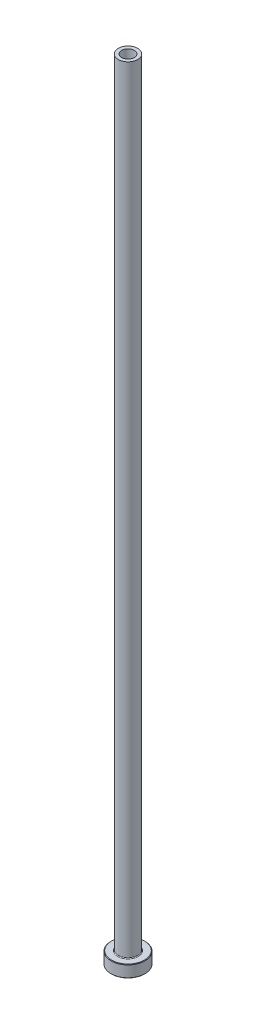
from build123d import *

# Parameters (mm, degrees)
FILLET1_R     = 0.3
CHAMFER1_SIZE = 0.2
CHAMFER3_SIZE = 0.5


with BuildPart() as part:
    # Sketch1 → Revolve1 (revolve)
    with BuildSketch(Plane.XY, mode=Mode.PRIVATE) as revolve1_sk:
        Polygon((-2.6, 325), (-4, 325), (-4, 5), (-7, 5), (-7, 0), (-2.85, 0), (-2.85, 268), (-2.6, 280), align=None)
    revolve(revolve1_sk.sketch.rotate(Axis((0, 92.187680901, 0), (0, -1, 0)), 270), axis=Axis((0, 92.187680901, 0), (0, -1, 0)))

    # Fillet1
    fillet1_edges = [part.edges().sort_by_distance(p)[0] for p in [
        (0, 5, -4),
    ]]
    fillet(fillet1_edges, radius=FILLET1_R)

    # Chamfer1
    chamfer1_edges = [part.edges().sort_by_distance(p)[0] for p in [
        (0, 0, -7),
        (0, 5, -7),
    ]]
    chamfer(chamfer1_edges, length=CHAMFER1_SIZE)

    # Chamfer3
    chamfer3_edges = [part.edges().sort_by_distance(p)[0] for p in [
        (0, 0, -2.85),
    ]]
    chamfer(chamfer3_edges, length=CHAMFER3_SIZE)


solid = part.part
